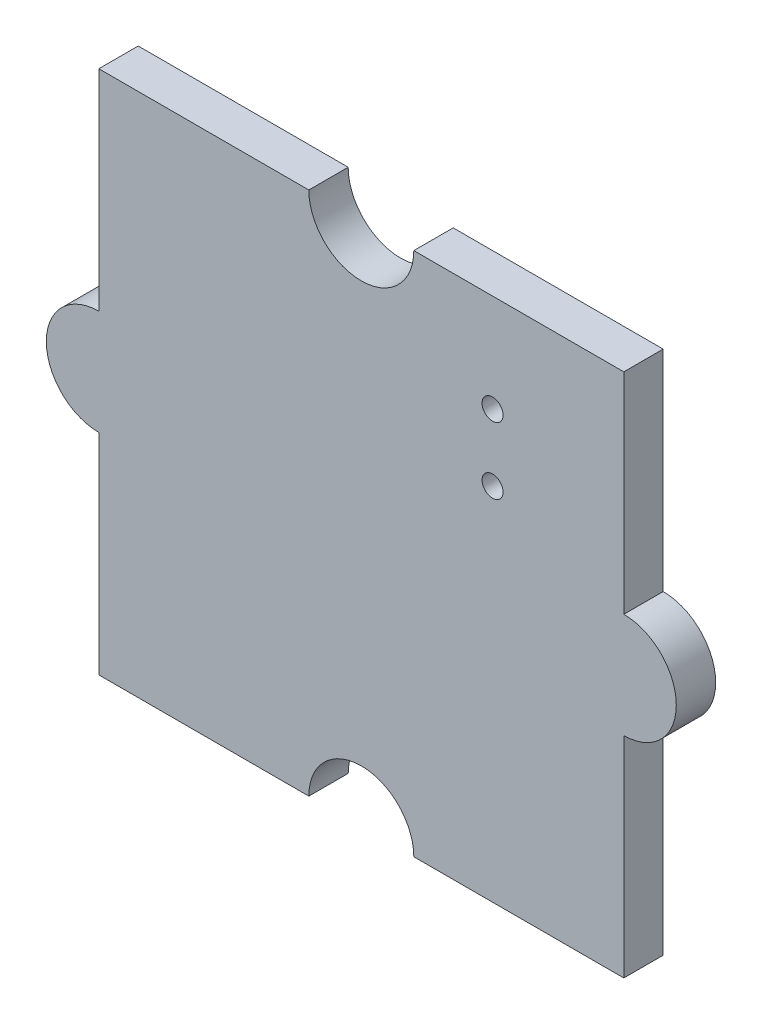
ISO-10303-21;
HEADER;
FILE_DESCRIPTION(('STEP AP214'),'2;1');
FILE_NAME('part.step','',(''),(''),'','','');
FILE_SCHEMA(('AUTOMOTIVE_DESIGN { 1 0 10303 214 1 1 1 1 }'));
ENDSEC;
DATA;
#1=APPLICATION_CONTEXT('core data for automotive mechanical design processes');
#2=APPLICATION_PROTOCOL_DEFINITION('international standard','automotive_design',2000,#1);
#3=PRODUCT_CONTEXT('',#1,'mechanical');
#4=PRODUCT('Part','Part','',(#3));
#5=PRODUCT_RELATED_PRODUCT_CATEGORY('part','',(#4));
#6=PRODUCT_DEFINITION_FORMATION('','',#4);
#7=PRODUCT_DEFINITION_CONTEXT('part definition',#1,'design');
#8=PRODUCT_DEFINITION('design','',#6,#7);
#9=PRODUCT_DEFINITION_SHAPE('','',#8);
#10=(LENGTH_UNIT() NAMED_UNIT(*) SI_UNIT(.MILLI.,.METRE.));
#11=(NAMED_UNIT(*) PLANE_ANGLE_UNIT() SI_UNIT($,.RADIAN.));
#12=(NAMED_UNIT(*) SI_UNIT($,.STERADIAN.) SOLID_ANGLE_UNIT());
#13=UNCERTAINTY_MEASURE_WITH_UNIT(LENGTH_MEASURE(1.E-05),#10,'distance_accuracy_value','');
#14=(GEOMETRIC_REPRESENTATION_CONTEXT(3) GLOBAL_UNCERTAINTY_ASSIGNED_CONTEXT((#13)) GLOBAL_UNIT_ASSIGNED_CONTEXT((#10,
#11,#12)) REPRESENTATION_CONTEXT('',''));
#15=CARTESIAN_POINT('',(0.,0.,0.));
#16=DIRECTION('',(0.,0.,1.));
#17=DIRECTION('',(1.,0.,0.));
#18=AXIS2_PLACEMENT_3D('',#15,#16,#17);
#19=CARTESIAN_POINT('',(0.,0.,1.5));
#20=DIRECTION('',(0.,1.,0.));
#21=DIRECTION('',(0.,0.,1.));
#22=AXIS2_PLACEMENT_3D('',#19,#20,#21);
#23=PLANE('',#22);
#24=DIRECTION('',(1.,0.,0.));
#25=VECTOR('',#24,1.);
#26=CARTESIAN_POINT('',(0.,0.,0.));
#27=LINE('',#26,#25);
#28=CARTESIAN_POINT('',(0.,0.,0.));
#29=VERTEX_POINT('',#28);
#30=CARTESIAN_POINT('',(8.,0.,0.));
#31=VERTEX_POINT('',#30);
#32=EDGE_CURVE('E166',#29,#31,#27,.T.);
#33=ORIENTED_EDGE('',*,*,#32,.T.);
#34=DIRECTION('',(0.,0.,1.));
#35=VECTOR('',#34,1.);
#36=CARTESIAN_POINT('',(8.,0.,-8.5));
#37=LINE('',#36,#35);
#38=CARTESIAN_POINT('',(8.,0.,1.5));
#39=VERTEX_POINT('',#38);
#40=EDGE_CURVE('E48',#31,#39,#37,.T.);
#41=ORIENTED_EDGE('',*,*,#40,.T.);
#42=DIRECTION('',(1.,0.,0.));
#43=VECTOR('',#42,1.);
#44=CARTESIAN_POINT('',(0.,0.,1.5));
#45=LINE('',#44,#43);
#46=CARTESIAN_POINT('',(0.,0.,1.5));
#47=VERTEX_POINT('',#46);
#48=EDGE_CURVE('E134',#47,#39,#45,.T.);
#49=ORIENTED_EDGE('',*,*,#48,.F.);
#50=DIRECTION('',(0.,0.,-1.));
#51=VECTOR('',#50,1.);
#52=CARTESIAN_POINT('',(0.,0.,1.5));
#53=LINE('',#52,#51);
#54=EDGE_CURVE('E200',#47,#29,#53,.T.);
#55=ORIENTED_EDGE('',*,*,#54,.T.);
#56=EDGE_LOOP('',(#33,#41,#49,#55));
#57=FACE_BOUND('',#56,.T.);
#58=ADVANCED_FACE('F33',(#57),#23,.F.);
#59=CARTESIAN_POINT('',(0.,20.,1.5));
#60=DIRECTION('',(0.,-1.,0.));
#61=DIRECTION('',(0.,0.,-1.));
#62=AXIS2_PLACEMENT_3D('',#59,#60,#61);
#63=PLANE('',#62);
#64=DIRECTION('',(-1.,0.,0.));
#65=VECTOR('',#64,1.);
#66=CARTESIAN_POINT('',(0.,20.,0.));
#67=LINE('',#66,#65);
#68=CARTESIAN_POINT('',(20.,20.,0.));
#69=VERTEX_POINT('',#68);
#70=CARTESIAN_POINT('',(12.,20.,0.));
#71=VERTEX_POINT('',#70);
#72=EDGE_CURVE('E176',#69,#71,#67,.T.);
#73=ORIENTED_EDGE('',*,*,#72,.T.);
#74=DIRECTION('',(0.,0.,1.));
#75=VECTOR('',#74,1.);
#76=CARTESIAN_POINT('',(12.,20.,-8.5));
#77=LINE('',#76,#75);
#78=CARTESIAN_POINT('',(12.,20.,1.5));
#79=VERTEX_POINT('',#78);
#80=EDGE_CURVE('E55',#71,#79,#77,.T.);
#81=ORIENTED_EDGE('',*,*,#80,.T.);
#82=DIRECTION('',(-1.,0.,0.));
#83=VECTOR('',#82,1.);
#84=CARTESIAN_POINT('',(0.,20.,1.5));
#85=LINE('',#84,#83);
#86=CARTESIAN_POINT('',(20.,20.,1.5));
#87=VERTEX_POINT('',#86);
#88=EDGE_CURVE('E153',#87,#79,#85,.T.);
#89=ORIENTED_EDGE('',*,*,#88,.F.);
#90=DIRECTION('',(0.,0.,-1.));
#91=VECTOR('',#90,1.);
#92=CARTESIAN_POINT('',(20.,20.,1.5));
#93=LINE('',#92,#91);
#94=EDGE_CURVE('E190',#87,#69,#93,.T.);
#95=ORIENTED_EDGE('',*,*,#94,.T.);
#96=EDGE_LOOP('',(#73,#81,#89,#95));
#97=FACE_BOUND('',#96,.T.);
#98=ADVANCED_FACE('F217',(#97),#63,.F.);
#99=CARTESIAN_POINT('',(0.,0.,1.5));
#100=DIRECTION('',(1.,0.,0.));
#101=DIRECTION('',(0.,0.,-1.));
#102=AXIS2_PLACEMENT_3D('',#99,#100,#101);
#103=PLANE('',#102);
#104=DIRECTION('',(0.,-1.,0.));
#105=VECTOR('',#104,1.);
#106=CARTESIAN_POINT('',(0.,0.,0.));
#107=LINE('',#106,#105);
#108=CARTESIAN_POINT('',(0.,8.,0.));
#109=VERTEX_POINT('',#108);
#110=EDGE_CURVE('E161',#109,#29,#107,.T.);
#111=ORIENTED_EDGE('',*,*,#110,.T.);
#112=ORIENTED_EDGE('',*,*,#54,.F.);
#113=DIRECTION('',(0.,-1.,0.));
#114=VECTOR('',#113,1.);
#115=CARTESIAN_POINT('',(0.,0.,1.5));
#116=LINE('',#115,#114);
#117=CARTESIAN_POINT('',(0.,8.,1.5));
#118=VERTEX_POINT('',#117);
#119=EDGE_CURVE('E140',#118,#47,#116,.T.);
#120=ORIENTED_EDGE('',*,*,#119,.F.);
#121=DIRECTION('',(0.,0.,-1.));
#122=VECTOR('',#121,1.);
#123=CARTESIAN_POINT('',(0.,8.,1.5));
#124=LINE('',#123,#122);
#125=EDGE_CURVE('E160',#118,#109,#124,.T.);
#126=ORIENTED_EDGE('',*,*,#125,.T.);
#127=EDGE_LOOP('',(#111,#112,#120,#126));
#128=FACE_BOUND('',#127,.T.);
#129=ADVANCED_FACE('F35',(#128),#103,.F.);
#130=CARTESIAN_POINT('',(12.,0.,1.5));
#131=VERTEX_POINT('',#130);
#132=CARTESIAN_POINT('',(20.,0.,1.5));
#133=VERTEX_POINT('',#132);
#134=EDGE_CURVE('E131',#131,#133,#45,.T.);
#135=ORIENTED_EDGE('',*,*,#134,.F.);
#136=DIRECTION('',(0.,0.,1.));
#137=VECTOR('',#136,1.);
#138=CARTESIAN_POINT('',(12.,0.,-8.5));
#139=LINE('',#138,#137);
#140=CARTESIAN_POINT('',(12.,0.,0.));
#141=VERTEX_POINT('',#140);
#142=EDGE_CURVE('E119',#131,#141,#139,.F.);
#143=ORIENTED_EDGE('',*,*,#142,.T.);
#144=CARTESIAN_POINT('',(20.,0.,0.));
#145=VERTEX_POINT('',#144);
#146=EDGE_CURVE('E164',#141,#145,#27,.T.);
#147=ORIENTED_EDGE('',*,*,#146,.T.);
#148=DIRECTION('',(0.,0.,-1.));
#149=VECTOR('',#148,1.);
#150=CARTESIAN_POINT('',(20.,0.,1.5));
#151=LINE('',#150,#149);
#152=EDGE_CURVE('E138',#133,#145,#151,.T.);
#153=ORIENTED_EDGE('',*,*,#152,.F.);
#154=EDGE_LOOP('',(#135,#143,#147,#153));
#155=FACE_BOUND('',#154,.T.);
#156=ADVANCED_FACE('F136',(#155),#23,.F.);
#157=CARTESIAN_POINT('',(20.,0.,1.5));
#158=DIRECTION('',(-1.,0.,0.));
#159=DIRECTION('',(0.,0.,1.));
#160=AXIS2_PLACEMENT_3D('',#157,#158,#159);
#161=PLANE('',#160);
#162=DIRECTION('',(0.,1.,0.));
#163=VECTOR('',#162,1.);
#164=CARTESIAN_POINT('',(20.,0.,0.));
#165=LINE('',#164,#163);
#166=CARTESIAN_POINT('',(20.,8.,0.));
#167=VERTEX_POINT('',#166);
#168=EDGE_CURVE('E169',#145,#167,#165,.T.);
#169=ORIENTED_EDGE('',*,*,#168,.T.);
#170=DIRECTION('',(0.,0.,-1.));
#171=VECTOR('',#170,1.);
#172=CARTESIAN_POINT('',(20.,8.,1.5));
#173=LINE('',#172,#171);
#174=CARTESIAN_POINT('',(20.,8.,1.5));
#175=VERTEX_POINT('',#174);
#176=EDGE_CURVE('E196',#175,#167,#173,.T.);
#177=ORIENTED_EDGE('',*,*,#176,.F.);
#178=DIRECTION('',(0.,1.,0.));
#179=VECTOR('',#178,1.);
#180=CARTESIAN_POINT('',(20.,0.,1.5));
#181=LINE('',#180,#179);
#182=EDGE_CURVE('E142',#133,#175,#181,.T.);
#183=ORIENTED_EDGE('',*,*,#182,.F.);
#184=ORIENTED_EDGE('',*,*,#152,.T.);
#185=EDGE_LOOP('',(#169,#177,#183,#184));
#186=FACE_BOUND('',#185,.T.);
#187=ADVANCED_FACE('F231',(#186),#161,.F.);
#188=CARTESIAN_POINT('',(20.,10.,1.5));
#189=DIRECTION('',(0.,0.,-1.));
#190=DIRECTION('',(-1.,0.,0.));
#191=AXIS2_PLACEMENT_3D('',#188,#189,#190);
#192=CYLINDRICAL_SURFACE('',#191,2.);
#193=CARTESIAN_POINT('',(20.,10.,0.));
#194=DIRECTION('',(0.,0.,1.));
#195=DIRECTION('',(1.,0.,0.));
#196=AXIS2_PLACEMENT_3D('',#193,#194,#195);
#197=CIRCLE('',#196,2.);
#198=CARTESIAN_POINT('',(20.,12.,0.));
#199=VERTEX_POINT('',#198);
#200=EDGE_CURVE('E171',#167,#199,#197,.T.);
#201=ORIENTED_EDGE('',*,*,#200,.T.);
#202=DIRECTION('',(0.,0.,-1.));
#203=VECTOR('',#202,1.);
#204=CARTESIAN_POINT('',(20.,12.,1.5));
#205=LINE('',#204,#203);
#206=CARTESIAN_POINT('',(20.,12.,1.5));
#207=VERTEX_POINT('',#206);
#208=EDGE_CURVE('E193',#207,#199,#205,.T.);
#209=ORIENTED_EDGE('',*,*,#208,.F.);
#210=CARTESIAN_POINT('',(20.,10.,1.5));
#211=DIRECTION('',(0.,0.,1.));
#212=DIRECTION('',(1.,0.,0.));
#213=AXIS2_PLACEMENT_3D('',#210,#211,#212);
#214=CIRCLE('',#213,2.);
#215=EDGE_CURVE('E148',#175,#207,#214,.T.);
#216=ORIENTED_EDGE('',*,*,#215,.F.);
#217=ORIENTED_EDGE('',*,*,#176,.T.);
#218=EDGE_LOOP('',(#201,#209,#216,#217));
#219=FACE_BOUND('',#218,.T.);
#220=ADVANCED_FACE('F227',(#219),#192,.T.);
#221=CARTESIAN_POINT('',(20.,12.,1.5));
#222=DIRECTION('',(-1.,0.,0.));
#223=DIRECTION('',(0.,0.,1.));
#224=AXIS2_PLACEMENT_3D('',#221,#222,#223);
#225=PLANE('',#224);
#226=DIRECTION('',(0.,1.,0.));
#227=VECTOR('',#226,1.);
#228=CARTESIAN_POINT('',(20.,12.,0.));
#229=LINE('',#228,#227);
#230=EDGE_CURVE('E173',#199,#69,#229,.T.);
#231=ORIENTED_EDGE('',*,*,#230,.T.);
#232=ORIENTED_EDGE('',*,*,#94,.F.);
#233=DIRECTION('',(0.,1.,0.));
#234=VECTOR('',#233,1.);
#235=CARTESIAN_POINT('',(20.,12.,1.5));
#236=LINE('',#235,#234);
#237=EDGE_CURVE('E150',#207,#87,#236,.T.);
#238=ORIENTED_EDGE('',*,*,#237,.F.);
#239=ORIENTED_EDGE('',*,*,#208,.T.);
#240=EDGE_LOOP('',(#231,#232,#238,#239));
#241=FACE_BOUND('',#240,.T.);
#242=ADVANCED_FACE('F222',(#241),#225,.F.);
#243=CARTESIAN_POINT('',(8.,20.,1.5));
#244=VERTEX_POINT('',#243);
#245=CARTESIAN_POINT('',(0.,20.,1.5));
#246=VERTEX_POINT('',#245);
#247=EDGE_CURVE('E152',#244,#246,#85,.T.);
#248=ORIENTED_EDGE('',*,*,#247,.F.);
#249=DIRECTION('',(0.,0.,1.));
#250=VECTOR('',#249,1.);
#251=CARTESIAN_POINT('',(8.,20.,-8.5));
#252=LINE('',#251,#250);
#253=CARTESIAN_POINT('',(8.,20.,0.));
#254=VERTEX_POINT('',#253);
#255=EDGE_CURVE('E236',#244,#254,#252,.F.);
#256=ORIENTED_EDGE('',*,*,#255,.T.);
#257=CARTESIAN_POINT('',(0.,20.,0.));
#258=VERTEX_POINT('',#257);
#259=EDGE_CURVE('E175',#254,#258,#67,.T.);
#260=ORIENTED_EDGE('',*,*,#259,.T.);
#261=DIRECTION('',(0.,0.,-1.));
#262=VECTOR('',#261,1.);
#263=CARTESIAN_POINT('',(0.,20.,1.5));
#264=LINE('',#263,#262);
#265=EDGE_CURVE('E187',#246,#258,#264,.T.);
#266=ORIENTED_EDGE('',*,*,#265,.F.);
#267=EDGE_LOOP('',(#248,#256,#260,#266));
#268=FACE_BOUND('',#267,.T.);
#269=ADVANCED_FACE('F239',(#268),#63,.F.);
#270=CARTESIAN_POINT('',(0.,12.,1.5));
#271=DIRECTION('',(1.,0.,0.));
#272=DIRECTION('',(0.,0.,-1.));
#273=AXIS2_PLACEMENT_3D('',#270,#271,#272);
#274=PLANE('',#273);
#275=DIRECTION('',(0.,-1.,0.));
#276=VECTOR('',#275,1.);
#277=CARTESIAN_POINT('',(0.,12.,0.));
#278=LINE('',#277,#276);
#279=CARTESIAN_POINT('',(0.,12.,0.));
#280=VERTEX_POINT('',#279);
#281=EDGE_CURVE('E179',#258,#280,#278,.T.);
#282=ORIENTED_EDGE('',*,*,#281,.T.);
#283=DIRECTION('',(0.,0.,-1.));
#284=VECTOR('',#283,1.);
#285=CARTESIAN_POINT('',(0.,12.,1.5));
#286=LINE('',#285,#284);
#287=CARTESIAN_POINT('',(0.,12.,1.5));
#288=VERTEX_POINT('',#287);
#289=EDGE_CURVE('E184',#288,#280,#286,.T.);
#290=ORIENTED_EDGE('',*,*,#289,.F.);
#291=DIRECTION('',(0.,-1.,0.));
#292=VECTOR('',#291,1.);
#293=CARTESIAN_POINT('',(0.,12.,1.5));
#294=LINE('',#293,#292);
#295=EDGE_CURVE('E156',#246,#288,#294,.T.);
#296=ORIENTED_EDGE('',*,*,#295,.F.);
#297=ORIENTED_EDGE('',*,*,#265,.T.);
#298=EDGE_LOOP('',(#282,#290,#296,#297));
#299=FACE_BOUND('',#298,.T.);
#300=ADVANCED_FACE('F243',(#299),#274,.F.);
#301=CARTESIAN_POINT('',(0.,10.,1.5));
#302=DIRECTION('',(0.,0.,-1.));
#303=DIRECTION('',(-1.,0.,0.));
#304=AXIS2_PLACEMENT_3D('',#301,#302,#303);
#305=CYLINDRICAL_SURFACE('',#304,2.);
#306=CARTESIAN_POINT('',(0.,10.,0.));
#307=DIRECTION('',(0.,0.,1.));
#308=DIRECTION('',(1.,0.,0.));
#309=AXIS2_PLACEMENT_3D('',#306,#307,#308);
#310=CIRCLE('',#309,2.);
#311=EDGE_CURVE('E143',#280,#109,#310,.T.);
#312=ORIENTED_EDGE('',*,*,#311,.T.);
#313=ORIENTED_EDGE('',*,*,#125,.F.);
#314=CARTESIAN_POINT('',(0.,10.,1.5));
#315=DIRECTION('',(0.,0.,1.));
#316=DIRECTION('',(1.,0.,0.));
#317=AXIS2_PLACEMENT_3D('',#314,#315,#316);
#318=CIRCLE('',#317,2.);
#319=EDGE_CURVE('E158',#288,#118,#318,.T.);
#320=ORIENTED_EDGE('',*,*,#319,.F.);
#321=ORIENTED_EDGE('',*,*,#289,.T.);
#322=EDGE_LOOP('',(#312,#313,#320,#321));
#323=FACE_BOUND('',#322,.T.);
#324=ADVANCED_FACE('F249',(#323),#305,.T.);
#325=CARTESIAN_POINT('',(0.,10.,1.5));
#326=DIRECTION('',(0.,0.,1.));
#327=DIRECTION('',(1.,0.,0.));
#328=AXIS2_PLACEMENT_3D('',#325,#326,#327);
#329=PLANE('',#328);
#330=CARTESIAN_POINT('',(10.,0.,1.5));
#331=DIRECTION('',(0.,0.,1.));
#332=DIRECTION('',(1.,0.,0.));
#333=AXIS2_PLACEMENT_3D('',#330,#331,#332);
#334=CIRCLE('',#333,2.);
#335=EDGE_CURVE('E122',#131,#39,#334,.T.);
#336=ORIENTED_EDGE('',*,*,#335,.F.);
#337=ORIENTED_EDGE('',*,*,#134,.T.);
#338=ORIENTED_EDGE('',*,*,#182,.T.);
#339=ORIENTED_EDGE('',*,*,#215,.T.);
#340=ORIENTED_EDGE('',*,*,#237,.T.);
#341=ORIENTED_EDGE('',*,*,#88,.T.);
#342=CARTESIAN_POINT('',(10.,20.,1.5));
#343=DIRECTION('',(0.,0.,1.));
#344=DIRECTION('',(1.,0.,0.));
#345=AXIS2_PLACEMENT_3D('',#342,#343,#344);
#346=CIRCLE('',#345,2.);
#347=EDGE_CURVE('E233',#244,#79,#346,.T.);
#348=ORIENTED_EDGE('',*,*,#347,.F.);
#349=ORIENTED_EDGE('',*,*,#247,.T.);
#350=ORIENTED_EDGE('',*,*,#295,.T.);
#351=ORIENTED_EDGE('',*,*,#319,.T.);
#352=ORIENTED_EDGE('',*,*,#119,.T.);
#353=ORIENTED_EDGE('',*,*,#48,.T.);
#354=EDGE_LOOP('',(#336,#337,#338,#339,#340,#341,#348,#349,#350,#351,#352,#353));
#355=FACE_BOUND('',#354,.T.);
#356=CARTESIAN_POINT('',(15.,16.27,1.5));
#357=DIRECTION('',(0.,0.,1.));
#358=DIRECTION('',(-1.,0.,0.));
#359=AXIS2_PLACEMENT_3D('',#356,#357,#358);
#360=CIRCLE('',#359,0.400000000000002);
#361=CARTESIAN_POINT('',(14.6,16.27,1.5));
#362=VERTEX_POINT('',#361);
#363=EDGE_CURVE('E208',#362,#362,#360,.T.);
#364=ORIENTED_EDGE('',*,*,#363,.F.);
#365=EDGE_LOOP('',(#364));
#366=FACE_BOUND('',#365,.T.);
#367=CARTESIAN_POINT('',(15.,13.73,1.5));
#368=DIRECTION('',(0.,0.,1.));
#369=DIRECTION('',(1.,0.,0.));
#370=AXIS2_PLACEMENT_3D('',#367,#368,#369);
#371=CIRCLE('',#370,0.400000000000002);
#372=CARTESIAN_POINT('',(15.4,13.73,1.5));
#373=VERTEX_POINT('',#372);
#374=EDGE_CURVE('E205',#373,#373,#371,.T.);
#375=ORIENTED_EDGE('',*,*,#374,.F.);
#376=EDGE_LOOP('',(#375));
#377=FACE_BOUND('',#376,.T.);
#378=ADVANCED_FACE('F129',(#355,#366,#377),#329,.T.);
#379=CARTESIAN_POINT('',(0.,10.,0.));
#380=DIRECTION('',(0.,0.,1.));
#381=DIRECTION('',(1.,0.,0.));
#382=AXIS2_PLACEMENT_3D('',#379,#380,#381);
#383=PLANE('',#382);
#384=CARTESIAN_POINT('',(15.,16.27,0.));
#385=DIRECTION('',(0.,0.,1.));
#386=DIRECTION('',(1.,0.,0.));
#387=AXIS2_PLACEMENT_3D('',#384,#385,#386);
#388=CIRCLE('',#387,0.400000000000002);
#389=CARTESIAN_POINT('',(15.4,16.27,0.));
#390=VERTEX_POINT('',#389);
#391=EDGE_CURVE('E206',#390,#390,#388,.T.);
#392=ORIENTED_EDGE('',*,*,#391,.T.);
#393=EDGE_LOOP('',(#392));
#394=FACE_BOUND('',#393,.T.);
#395=CARTESIAN_POINT('',(15.,13.73,0.));
#396=DIRECTION('',(0.,0.,1.));
#397=DIRECTION('',(1.,0.,0.));
#398=AXIS2_PLACEMENT_3D('',#395,#396,#397);
#399=CIRCLE('',#398,0.400000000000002);
#400=CARTESIAN_POINT('',(15.4,13.73,0.));
#401=VERTEX_POINT('',#400);
#402=EDGE_CURVE('E165',#401,#401,#399,.T.);
#403=ORIENTED_EDGE('',*,*,#402,.T.);
#404=EDGE_LOOP('',(#403));
#405=FACE_BOUND('',#404,.T.);
#406=ORIENTED_EDGE('',*,*,#146,.F.);
#407=CARTESIAN_POINT('',(10.,0.,0.));
#408=DIRECTION('',(0.,0.,1.));
#409=DIRECTION('',(1.,0.,0.));
#410=AXIS2_PLACEMENT_3D('',#407,#408,#409);
#411=CIRCLE('',#410,2.);
#412=EDGE_CURVE('E11',#141,#31,#411,.T.);
#413=ORIENTED_EDGE('',*,*,#412,.T.);
#414=ORIENTED_EDGE('',*,*,#32,.F.);
#415=ORIENTED_EDGE('',*,*,#110,.F.);
#416=ORIENTED_EDGE('',*,*,#311,.F.);
#417=ORIENTED_EDGE('',*,*,#281,.F.);
#418=ORIENTED_EDGE('',*,*,#259,.F.);
#419=CARTESIAN_POINT('',(10.,20.,0.));
#420=DIRECTION('',(0.,0.,1.));
#421=DIRECTION('',(1.,0.,0.));
#422=AXIS2_PLACEMENT_3D('',#419,#420,#421);
#423=CIRCLE('',#422,2.);
#424=EDGE_CURVE('E41',#254,#71,#423,.T.);
#425=ORIENTED_EDGE('',*,*,#424,.T.);
#426=ORIENTED_EDGE('',*,*,#72,.F.);
#427=ORIENTED_EDGE('',*,*,#230,.F.);
#428=ORIENTED_EDGE('',*,*,#200,.F.);
#429=ORIENTED_EDGE('',*,*,#168,.F.);
#430=EDGE_LOOP('',(#406,#413,#414,#415,#416,#417,#418,#425,#426,#427,#428,#429));
#431=FACE_BOUND('',#430,.T.);
#432=ADVANCED_FACE('F212',(#394,#405,#431),#383,.F.);
#433=CARTESIAN_POINT('',(15.,13.73,-8.5));
#434=DIRECTION('',(0.,0.,1.));
#435=DIRECTION('',(1.,0.,0.));
#436=AXIS2_PLACEMENT_3D('',#433,#434,#435);
#437=CYLINDRICAL_SURFACE('',#436,0.400000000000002);
#438=ORIENTED_EDGE('',*,*,#374,.T.);
#439=EDGE_LOOP('',(#438));
#440=FACE_BOUND('',#439,.T.);
#441=ORIENTED_EDGE('',*,*,#402,.F.);
#442=EDGE_LOOP('',(#441));
#443=FACE_BOUND('',#442,.T.);
#444=ADVANCED_FACE('F262',(#440,#443),#437,.F.);
#445=CARTESIAN_POINT('',(15.,16.27,-8.5));
#446=DIRECTION('',(0.,0.,1.));
#447=DIRECTION('',(1.,0.,0.));
#448=AXIS2_PLACEMENT_3D('',#445,#446,#447);
#449=CYLINDRICAL_SURFACE('',#448,0.400000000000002);
#450=ORIENTED_EDGE('',*,*,#363,.T.);
#451=EDGE_LOOP('',(#450));
#452=FACE_BOUND('',#451,.T.);
#453=ORIENTED_EDGE('',*,*,#391,.F.);
#454=EDGE_LOOP('',(#453));
#455=FACE_BOUND('',#454,.T.);
#456=ADVANCED_FACE('F351',(#452,#455),#449,.F.);
#457=CARTESIAN_POINT('',(10.,20.,-8.5));
#458=DIRECTION('',(0.,0.,1.));
#459=DIRECTION('',(1.,0.,0.));
#460=AXIS2_PLACEMENT_3D('',#457,#458,#459);
#461=CYLINDRICAL_SURFACE('',#460,2.);
#462=ORIENTED_EDGE('',*,*,#424,.F.);
#463=ORIENTED_EDGE('',*,*,#255,.F.);
#464=ORIENTED_EDGE('',*,*,#347,.T.);
#465=ORIENTED_EDGE('',*,*,#80,.F.);
#466=EDGE_LOOP('',(#462,#463,#464,#465));
#467=FACE_BOUND('',#466,.T.);
#468=ADVANCED_FACE('F356',(#467),#461,.F.);
#469=CARTESIAN_POINT('',(10.,0.,-8.5));
#470=DIRECTION('',(0.,0.,1.));
#471=DIRECTION('',(1.,0.,0.));
#472=AXIS2_PLACEMENT_3D('',#469,#470,#471);
#473=CYLINDRICAL_SURFACE('',#472,2.);
#474=ORIENTED_EDGE('',*,*,#412,.F.);
#475=ORIENTED_EDGE('',*,*,#142,.F.);
#476=ORIENTED_EDGE('',*,*,#335,.T.);
#477=ORIENTED_EDGE('',*,*,#40,.F.);
#478=EDGE_LOOP('',(#474,#475,#476,#477));
#479=FACE_BOUND('',#478,.T.);
#480=ADVANCED_FACE('F121',(#479),#473,.F.);
#481=CLOSED_SHELL('',(#58,#98,#129,#156,#187,#220,#242,#269,#300,#324,#378,#432,#444,#456,#468,#480));
#482=MANIFOLD_SOLID_BREP('B2',#481);
#483=ADVANCED_BREP_SHAPE_REPRESENTATION('',(#18,#482),#14);
#484=SHAPE_DEFINITION_REPRESENTATION(#9,#483);
ENDSEC;
END-ISO-10303-21;
